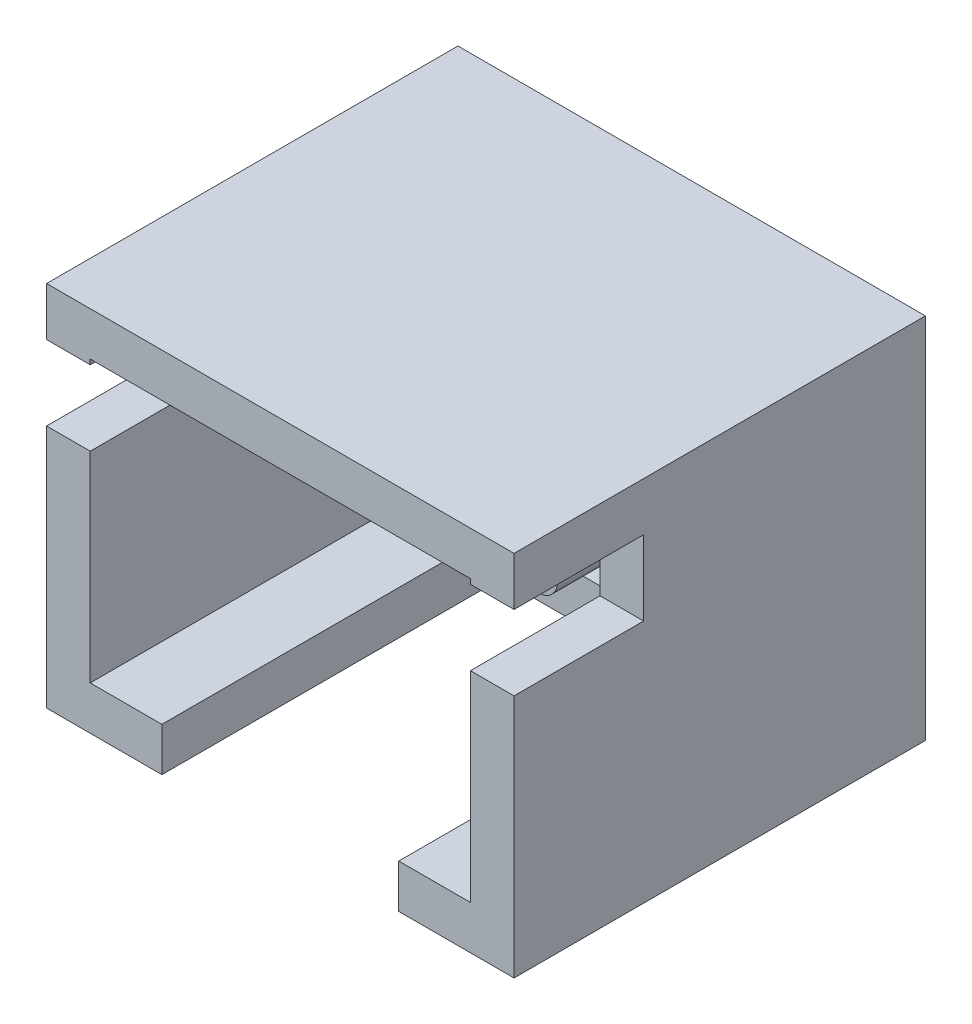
from build123d import *

# Parameters (mm, degrees)
ESQUISSE1_W             = 7.5
ESQUISSE1_H             = 5.9
EXTRUSION1_DEPTH        = 6.6
COQUE1_T                = -0.7
ESQUISSE2_W             = 2.07961519
ESQUISSE2_H             = 1.2
ENL_V_MAT_EXTRU_1_DEPTH = 12.040833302
ENL_V_MAT_EXTRU_2_REACH = 37.354
ESQUISSE3_W             = 3.8
ESQUISSE3_H             = 5.438100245
EXTRUSION2_DEPTH        = 3
EXTRUSION2_DEPTH_BACK   = 2
ESQUISSE4_R             = 0.302875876


with BuildPart() as part:
    # Esquisse1 → Extrusion1 (new body)
    with BuildSketch(Plane.XY):
        with Locations((30.47723449, 1.75)):
            Rectangle(ESQUISSE1_W, ESQUISSE1_H)
    extrude(amount=EXTRUSION1_DEPTH)

    # Coque1
    coque1_openings = [part.faces().sort_by_distance(p)[0] for p in [
        (30.47723449, 1.75, 6.6),
    ]]
    offset(amount=COQUE1_T, openings=coque1_openings, kind=Kind.INTERSECTION)

    # Esquisse2 → Enl_v. mat.-Extru.1 (cut, through all)
    with BuildSketch(Plane(origin=(34.22723449, 0, 0), x_dir=(0, 0, -1), z_dir=(1, 0, 0))):
        with Locations((-5.560192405, 3.320157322)):
            Rectangle(ESQUISSE2_W, ESQUISSE2_H)
    extrude(amount=-ENL_V_MAT_EXTRU_1_DEPTH, mode=Mode.SUBTRACT)

    # Esquisse3 → Enl_v. mat.-Extru.2 (cut, up to next)
    with BuildSketch(Plane.XZ.offset(1.2), mode=Mode.PRIVATE) as enl_v_mat_extru_2_sk1:
        with Locations((30.47723449, 3.880949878)):
            Rectangle(ESQUISSE3_W, ESQUISSE3_H)
    enl_v_mat_extru_2_tool1 = extrude(enl_v_mat_extru_2_sk1.sketch, amount=-ENL_V_MAT_EXTRU_2_REACH, mode=Mode.PRIVATE) & part.part
    add(enl_v_mat_extru_2_tool1.solids().sort_by_distance((30.477234, -1.2, 3.88095))[0], mode=Mode.SUBTRACT)

    # Esquisse4 → Extrusion2 (add, two sides: drawn at the far end of the back side and taken through both)
    with BuildSketch(Plane.XY.offset(0.7).offset(-EXTRUSION2_DEPTH_BACK)):
        with Locations(Location((29.220250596, 1.75, 0), (0, 0, 180))):
            Circle(ESQUISSE4_R)
        with Locations(Location((31.720250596, 1.75, 0), (0, 0, 180))):
            Circle(ESQUISSE4_R)
    extrude(amount=EXTRUSION2_DEPTH + EXTRUSION2_DEPTH_BACK)


solid = part.part
